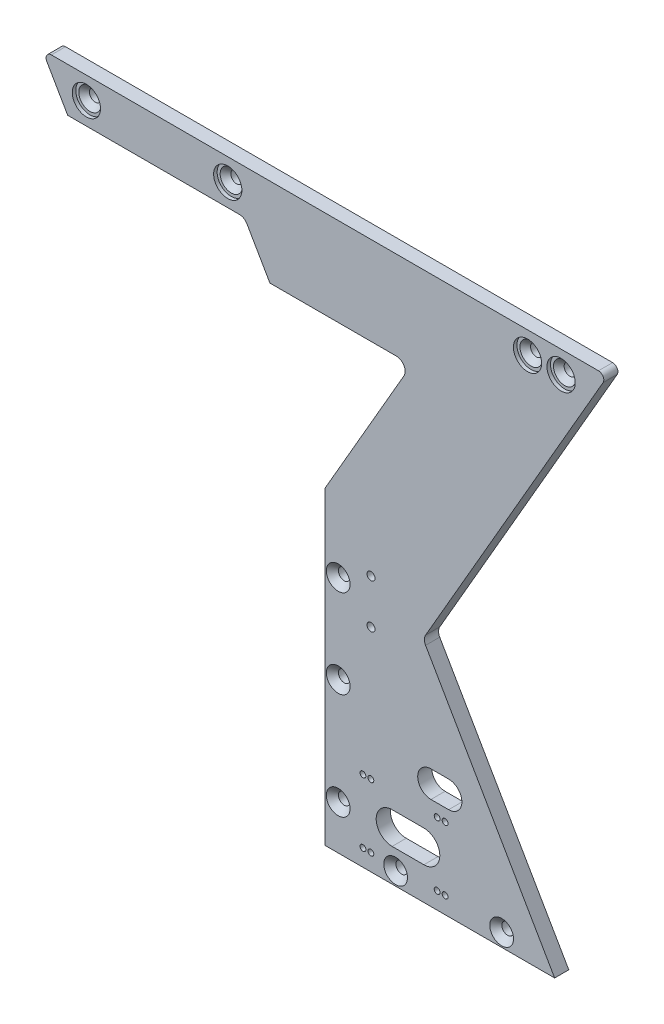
from build123d import *

# Parameters (mm, degrees)
BOSS_EXTRUDE1_DEPTH                            = 8
CSK_FOR_M6_SFHCS5_D                            = 6.6
CSK_FOR_M6_SFHCS5_CSINK_D                      = 13.44
CSK_FOR_M6_SFHCS5_CSINK_ANGLE                  = 90
CSK_FOR_M6_SFHCS7_D                            = 6.6
CSK_FOR_M6_SFHCS7_CSINK_D                      = 13.44
CSK_FOR_M6_SFHCS7_CSINK_ANGLE                  = 90
FILLET2_R                                      = 3
FILLET3_R                                      = 5
CUT_EXTRUDE2_DEPTH                             = 222.339229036
M3X0_5_TAPPED_HOLE2_D                          = 2.5
M3X0_5_TAPPED_HOLE2_DEPTH                      = 7
M3X0_5_TAPPED_HOLE2_TIP                        = 0.751075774
SKETCH72_R                                     = 8
CUT_EXTRUDE5_DEPTH                             = 2
SKETCH73_R                                     = 8
CUT_EXTRUDE6_DEPTH                             = 2
CSK_FOR_M6_FLAT_HEAD_MACHINE_SCREW4_AT_2_COUNT = 2
CSK_FOR_M6_FLAT_HEAD_MACHINE_SCREW4_AT_2_PITCH = 80
CSK_FOR_M6_FLAT_HEAD_MACHINE_SCREW4_AT_3_COUNT = 2
CSK_FOR_M6_FLAT_HEAD_MACHINE_SCREW4_AT_3_PITCH = 249.645644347
CSK_FOR_M6_FLAT_HEAD_MACHINE_SCREW4_AT_4_COUNT = 2
CSK_FOR_M6_FLAT_HEAD_MACHINE_SCREW4_AT_4_PITCH = 268.645644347
F_4_5_4_5_DIAMETER_HOLE1_D                     = 4.5
CUT_EXTRUDE10_DEPTH                            = 222.339229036
M4X0_7_TAPPED_HOLE1_D                          = 3.3
M3X0_5_TAPPED_HOLE4_D                          = 2.5
M3X0_5_TAPPED_HOLE4_DEPTH                      = 6
M3X0_5_TAPPED_HOLE4_TIP                        = 0.751075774
LPATTERN1_COUNT                                = 2
LPATTERN1_PITCH                                = 4.5


with BuildPart() as part:
    # Sketch1 → Boss-Extrude1 (new body)
    with BuildSketch(Plane.XY):
        Polygon((0, -155), (130, -155), (55.510708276, -25.980762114), (160, 155), (-160, 155), (-145.56624327, 130), (-45.56624327, 130), (-31.132486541, 105), (49.074772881, 105), (0, 20), align=None)
    extrude(amount=BOSS_EXTRUDE1_DEPTH)

    # CSK for M6 SFHCS5 (through all)
    with Locations(Plane.XY.offset(8)):
        with Locations((7.5, -70), (7.5, -130)):
            CounterSinkHole(CSK_FOR_M6_SFHCS5_D / 2, CSK_FOR_M6_SFHCS5_CSINK_D / 2, counter_sink_angle=CSK_FOR_M6_SFHCS5_CSINK_ANGLE)

    # CSK for M6 SFHCS7 (through all)
    with Locations(Plane.XY.offset(8)):
        with Locations((7.5, -20), (40, -147.5), (100, -147.5)):
            CounterSinkHole(CSK_FOR_M6_SFHCS7_D / 2, CSK_FOR_M6_SFHCS7_CSINK_D / 2, counter_sink_angle=CSK_FOR_M6_SFHCS7_CSINK_ANGLE)

    # Fillet2
    fillet2_edges = [part.edges().sort_by_distance(p)[0] for p in [
        (-160, 155, 4),
        (160, 155, 4),
    ]]
    fillet(fillet2_edges, radius=FILLET2_R)

    # Fillet3
    fillet3_edges = [part.edges().sort_by_distance(p)[0] for p in [
        (49.074772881, 105, 4),
        (-45.56624327, 130, 4),
        (55.510708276, -25.980762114, 4),
    ]]
    fillet(fillet3_edges, radius=FILLET3_R)

    # Sketch29 → Cut-Extrude2 (cut, through all)
    with BuildSketch(Plane(origin=(0, 0, 0), x_dir=(-1, 0, 0), z_dir=(0, 0, -1))):
        with BuildLine():
            Line((-60, -102.5), (-70, -102.5))
            ThreePointArc((-70, -102.5), (-77.5, -95), (-70, -87.5))
            Line((-70, -87.5), (-60, -87.5))
            ThreePointArc((-60, -87.5), (-52.5, -95), (-60, -102.5))
        make_face()
    extrude(amount=-CUT_EXTRUDE2_DEPTH, mode=Mode.SUBTRACT)

    # M3x0.5 Tapped Hole2
    with Locations(Plane(origin=(0, 0, 0), x_dir=(-1, 0, 0), z_dir=(0, 0, -1))):
        with Locations((-20.503502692, 115), (-4.503502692, 115)):
            Hole(M3X0_5_TAPPED_HOLE2_D / 2, depth=M3X0_5_TAPPED_HOLE2_DEPTH)
            with Locations((0, 0, -(M3X0_5_TAPPED_HOLE2_DEPTH + M3X0_5_TAPPED_HOLE2_TIP / 2))):  # 118° drill point
                Cone(0, M3X0_5_TAPPED_HOLE2_D / 2, M3X0_5_TAPPED_HOLE2_TIP, mode=Mode.SUBTRACT)

    # Sketch72 → Cut-Extrude5 (cut)
    with BuildSketch(Plane.XY.offset(8)):
        with Locations((-134.996497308, 142.5)):
            Circle(SKETCH72_R)
        with Locations((-54.996497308, 142.5)):
            Circle(SKETCH72_R)
    extrude(amount=-CUT_EXTRUDE5_DEPTH, mode=Mode.SUBTRACT)

    # Sketch73 → Cut-Extrude6 (cut)
    with BuildSketch(Plane.XY.offset(8)):
        with Locations((114.649147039, 142.5)):
            Circle(SKETCH73_R)
        with Locations((133.649147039, 142.5)):
            Circle(SKETCH73_R)
    extrude(amount=-CUT_EXTRUDE6_DEPTH, mode=Mode.SUBTRACT)

    # Sketch76 → CSK for M6 Flat Head Machine Screw4 (revolve, cut)
    with BuildSketch(Plane(origin=(-134.996497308, 142.5, 6), x_dir=(0, -1, 0), z_dir=(1, 0, 0))):
        Polygon((0, 0), (0, 6), (3.3, 6), (3.3, 3), (6.3, 0), align=None)
    csk_for_m6_flat_head_machine_screw4 = revolve(axis=Axis((-134.996497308, 142.5, 12.35), (0, 0, -1)), mode=Mode.SUBTRACT)

    # CSK for M6 Flat Head Machine Screw4 at 2: CSK for M6 Flat Head Machine Screw4 ×2
    with Locations(*[(i * CSK_FOR_M6_FLAT_HEAD_MACHINE_SCREW4_AT_2_PITCH, 0, 0) for i in range(1, CSK_FOR_M6_FLAT_HEAD_MACHINE_SCREW4_AT_2_COUNT)]):
        add(csk_for_m6_flat_head_machine_screw4, mode=Mode.SUBTRACT)

    # CSK for M6 Flat Head Machine Screw4 at 3: CSK for M6 Flat Head Machine Screw4 ×2
    with Locations(*[(i * CSK_FOR_M6_FLAT_HEAD_MACHINE_SCREW4_AT_3_PITCH, 0, 0) for i in range(1, CSK_FOR_M6_FLAT_HEAD_MACHINE_SCREW4_AT_3_COUNT)]):
        add(csk_for_m6_flat_head_machine_screw4, mode=Mode.SUBTRACT)

    # CSK for M6 Flat Head Machine Screw4 at 4: CSK for M6 Flat Head Machine Screw4 ×2
    with Locations(*[(i * CSK_FOR_M6_FLAT_HEAD_MACHINE_SCREW4_AT_4_PITCH, 0, 0) for i in range(1, CSK_FOR_M6_FLAT_HEAD_MACHINE_SCREW4_AT_4_COUNT)]):
        add(csk_for_m6_flat_head_machine_screw4, mode=Mode.SUBTRACT)

    # 4.5 _4.5_ Diameter Hole1 (through all)
    with Locations(Plane.XY.offset(8)):
        with Locations((26.076951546, -10), (26.076951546, -35)):
            Hole(F_4_5_4_5_DIAMETER_HOLE1_D / 2)

    # Sketch89 → Cut-Extrude10 (cut, through all)
    with BuildSketch(Plane.XY.offset(8)):
        with BuildLine():
            Line((38, -118.5), (56, -118.5))
            ThreePointArc((56, -118.5), (65, -127.5), (56, -136.5))
            Line((56, -136.5), (38, -136.5))
            ThreePointArc((38, -136.5), (29, -127.5), (38, -118.5))
        make_face()
    extrude(amount=-CUT_EXTRUDE10_DEPTH, mode=Mode.SUBTRACT)

    # M4x0.7 Tapped Hole1 (through all)
    with Locations(Plane.XY.offset(8)):
        with Locations((26, -145.5), (26, -109.5), (68, -109.5), (68, -145.5)):
            m4x0_7_tapped_hole1 = Hole(M4X0_7_TAPPED_HOLE1_D / 2)

    # M3x0.5 Tapped Hole4
    with Locations(Plane(origin=(0, 0, 0), x_dir=(-1, 0, 0), z_dir=(0, 0, -1))):
        with Locations((-123.097845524, 121), (-97.097845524, 146), (-45.097845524, 146), (-61.097845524, 119), (-22.402818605, 29), (-70.402818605, 29)):
            Hole(M3X0_5_TAPPED_HOLE4_D / 2, depth=M3X0_5_TAPPED_HOLE4_DEPTH)
            with Locations((0, 0, -(M3X0_5_TAPPED_HOLE4_DEPTH + M3X0_5_TAPPED_HOLE4_TIP / 2))):  # 118° drill point
                Cone(0, M3X0_5_TAPPED_HOLE4_D / 2, M3X0_5_TAPPED_HOLE4_TIP, mode=Mode.SUBTRACT)

    # LPattern1: M4x0.7 Tapped Hole1 ×2
    with Locations(*[(-i * LPATTERN1_PITCH, 0, 0) for i in range(1, LPATTERN1_COUNT)]):
        add(m4x0_7_tapped_hole1, mode=Mode.SUBTRACT)


solid = part.part
